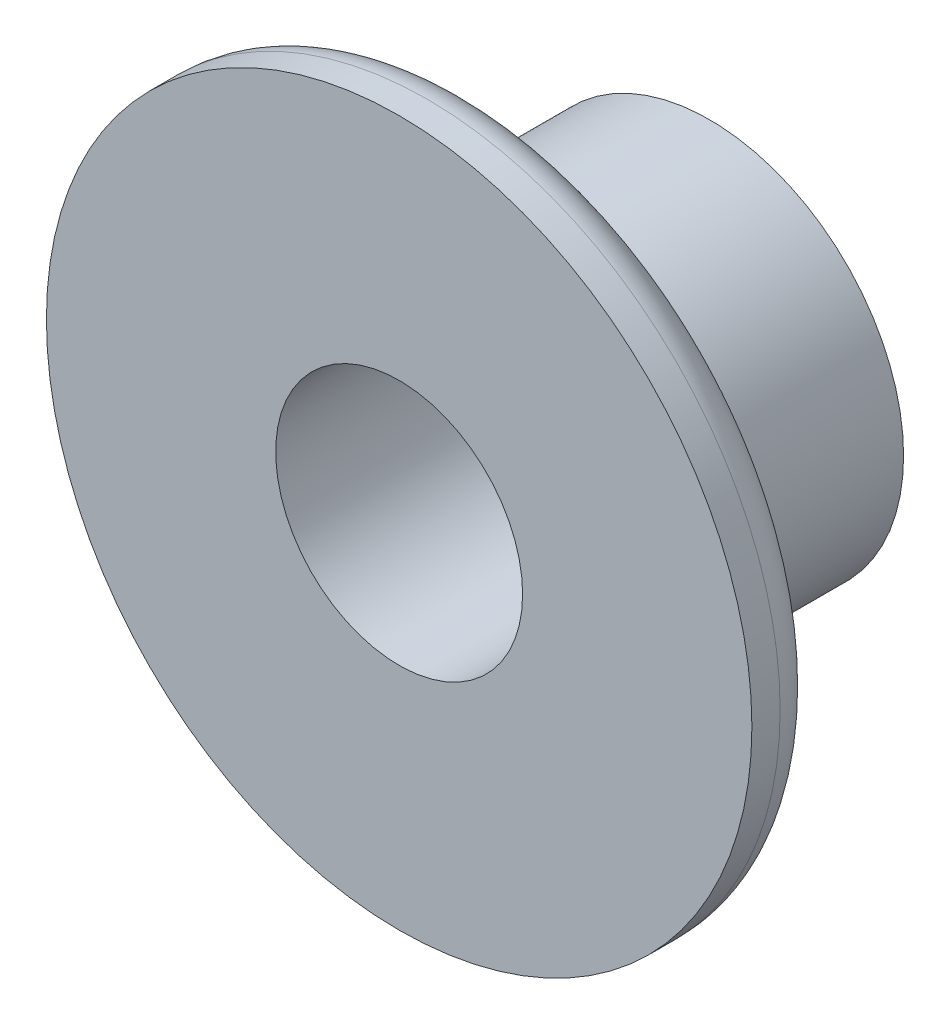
from build123d import *

# Parameters (mm, degrees)
SKETCH1_R           = 3.4925
SKETCH1_R_2         = 2.2225
BOSS_EXTRUDE1_DEPTH = 5.588
BOSS_EXTRUDE2_START = -1.27
SKETCH2_R           = 6.35
SKETCH2_R_2         = 2.2225
BOSS_EXTRUDE2_DEPTH = 1.27
FILLET1_R           = 0.762


with BuildPart() as part:
    # Sketch1 → Boss-Extrude1 (new body)
    with BuildSketch(Plane.XY):
        Circle(SKETCH1_R)
        Circle(SKETCH1_R_2, mode=Mode.SUBTRACT)
    extrude(amount=BOSS_EXTRUDE1_DEPTH)

    # Sketch2 → Boss-Extrude2 (add)
    with BuildSketch(Plane.XY.offset(5.588).offset(BOSS_EXTRUDE2_START)):
        Circle(SKETCH2_R)
        Circle(SKETCH2_R_2, mode=Mode.SUBTRACT)
    extrude(amount=BOSS_EXTRUDE2_DEPTH)

    # Fillet1
    fillet1_edges = [part.edges().sort_by_distance(p)[0] for p in [
        (-3.4925, 0, 4.318),
        (-6.35, 0, 4.318),
    ]]
    fillet(fillet1_edges, radius=FILLET1_R)


solid = part.part
